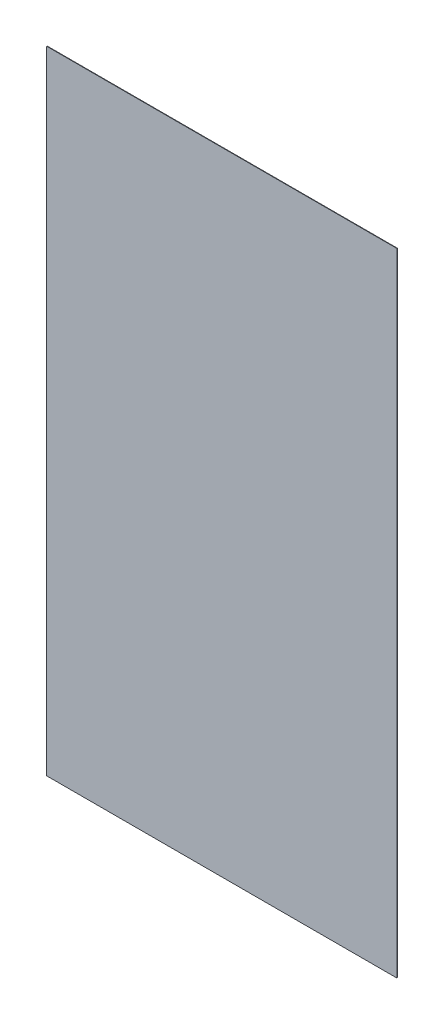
from build123d import *

# Parameters (mm, degrees)
SKETCH1_W           = 7.62
SKETCH1_H           = 13.754
BOSS_EXTRUDE1_DEPTH = 0.01


with BuildPart() as part:
    # Sketch1 → Boss-Extrude1 (new body)
    with BuildSketch(Plane.XY):
        with Locations((0, 6.877)):
            Rectangle(SKETCH1_W, SKETCH1_H)
    extrude(amount=BOSS_EXTRUDE1_DEPTH)


solid = part.part
